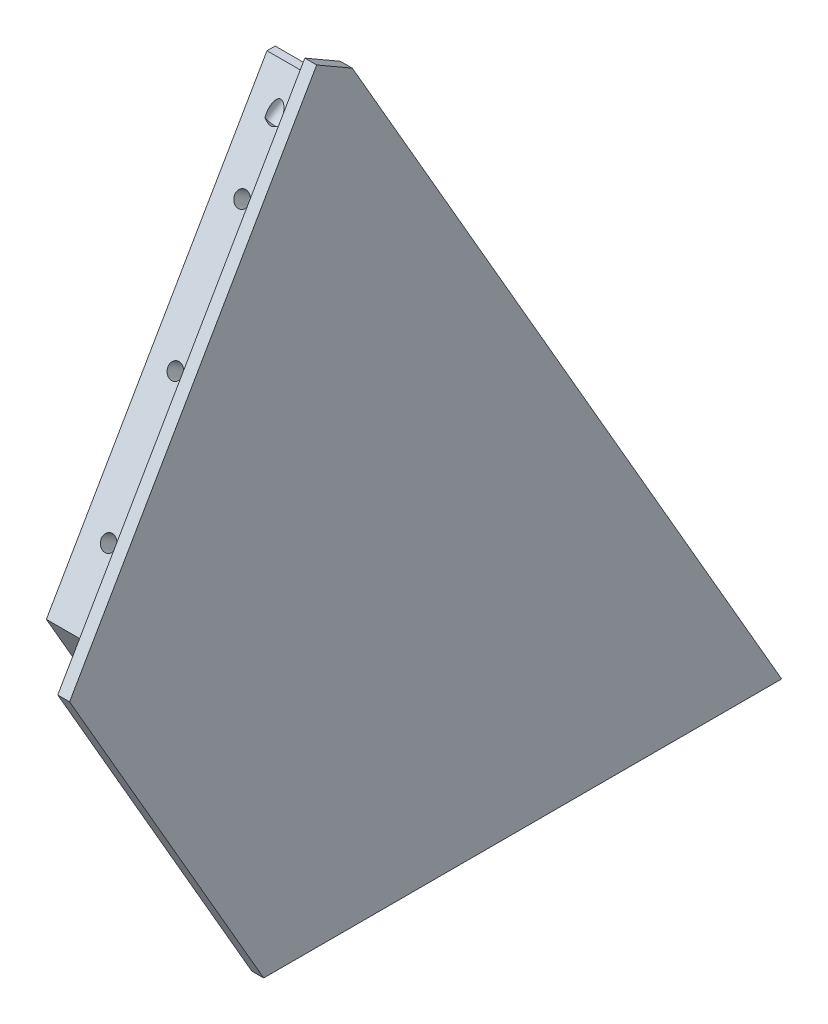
from build123d import *

# Parameters (mm, degrees)
BOSS_EXTRUDE1_DEPTH            = 12
CUT_EXTRUDE1_DEPTH             = 150.122275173
CUT_EXTRUDE2_DEPTH             = 10
CUT_EXTRUDE4_DEPTH             = 10
SKETCH7_W                      = 76
SKETCH7_H                      = 8
CUT_EXTRUDE6_DEPTH             = 10
CUT_EXTRUDE8_DEPTH             = 9
CUT_EXTRUDE9_DEPTH             = 6
CUT_EXTRUDE12_DEPTH            = 10
CUT_EXTRUDE13_DEPTH            = 10
FILLET1_R                      = 5
FILLET2_R                      = 7.5
M3X0_5_TAPPED_HOLE2_D          = 2.5
M3X0_5_TAPPED_HOLE2_DEPTH      = 8.5
M3X0_5_TAPPED_HOLE2_TIP        = 0.751075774
F_3_1_3_1_DIAMETER_HOLE2_D     = 3.1
F_3_1_3_1_DIAMETER_HOLE2_DEPTH = 5
M3X0_5_TAPPED_HOLE4_D          = 2.5
M3X0_5_TAPPED_HOLE4_DEPTH      = 5
M3X0_5_TAPPED_HOLE5_D          = 2.5
M3X0_5_TAPPED_HOLE5_DEPTH      = 8.5
M3X0_5_TAPPED_HOLE5_TIP        = 0.751075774
M3X0_5_TAPPED_HOLE7_D          = 2.5
M3X0_5_TAPPED_HOLE7_DEPTH      = 7.5
M3X0_5_TAPPED_HOLE7_TIP        = 0.751075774
M3X0_5_TAPPED_HOLE9_D          = 2.5
M3X0_5_TAPPED_HOLE9_DEPTH      = 4.69


with BuildPart() as part:
    # Sketch1 → Boss-Extrude1 (new body)
    with BuildSketch(Plane(origin=(0, 0, 0), x_dir=(0, 0, -1), z_dir=(1, 0, 0))):
        Polygon((-41.569219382, 102), (-67.729473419, 56.689110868), (-35, 0), (0, 0), (52.320508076, 0), (-24.069219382, 132.310889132), align=None)
    extrude(amount=BOSS_EXTRUDE1_DEPTH)

    # Sketch2 → Cut-Extrude1 (cut, through all)
    with BuildSketch(Plane(origin=(12, 0, 0), x_dir=(0, 0, -1), z_dir=(1, 0, 0))):
        Polygon((-26.069219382, 128.846787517), (-20.069219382, 125.382685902), (-24.069219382, 132.310889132), align=None)
    extrude(amount=-CUT_EXTRUDE1_DEPTH, mode=Mode.SUBTRACT)

    # Sketch3 → Cut-Extrude2 (cut)
    with BuildSketch(Plane.ZY):
        Polygon((26.069219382, 128.846787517), (27.069219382, 127.11473671), (21.533320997, 123.918584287), (-45, 8.679491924), (-45, 0), (-52.320508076, 0), (20.069219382, 125.382685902), align=None)
    extrude(amount=-CUT_EXTRUDE2_DEPTH, mode=Mode.SUBTRACT)

    # Sketch5 → Cut-Extrude4 (cut)
    with BuildSketch(Plane.ZY):
        Polygon((27.069219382, 127.11473671), (21.873066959, 124.11473671), (59.646569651, 58.689110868), (25.762395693, 0), (35, 0), (67.729473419, 56.689110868), align=None)
    extrude(amount=-CUT_EXTRUDE4_DEPTH, mode=Mode.SUBTRACT)

    # Sketch7 → Cut-Extrude6 (cut)
    with BuildSketch(Plane.ZY):
        with Locations((-7, 4)):
            Rectangle(SKETCH7_W, SKETCH7_H)
    extrude(amount=-CUT_EXTRUDE6_DEPTH, mode=Mode.SUBTRACT)

    # Sketch11 → Cut-Extrude8 (cut)
    with BuildSketch(Plane.ZY):
        Polygon((26.378620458, 106.310889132), (53.873066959, 58.689110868), (27.494446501, 13), (-27.494446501, 13), align=None)
    extrude(amount=-CUT_EXTRUDE8_DEPTH, mode=Mode.SUBTRACT)

    # Sketch13 → Cut-Extrude9 (cut)
    with BuildSketch(Plane.ZY):
        Polygon((16.771647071, 119.671123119), (25.700368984, 114.516123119), (-21.799631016, 32.243709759), (-30.728352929, 37.398709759), align=None)
    extrude(amount=-CUT_EXTRUDE9_DEPTH, mode=Mode.SUBTRACT)

    # Sketch16 → Cut-Extrude12 (cut)
    with BuildSketch(Plane.ZY):
        Polygon((-45, 8), (-44, 8), (-44, 10.411542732), (-45, 8.679491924), align=None)
    extrude(amount=-CUT_EXTRUDE12_DEPTH, mode=Mode.SUBTRACT)

    # Sketch17 → Cut-Extrude13 (cut)
    with BuildSketch(Plane.ZY):
        Polygon((22.450417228, 123.11473671), (21.069219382, 123.11473671), (21.533320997, 123.918584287), (21.873066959, 124.11473671), align=None)
    extrude(amount=-CUT_EXTRUDE13_DEPTH, mode=Mode.SUBTRACT)

    # Fillet1
    fillet1_edges = [part.edges().sort_by_distance(p)[0] for p in [
        (3, 32.243709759, -21.799631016),
        (3, 114.516123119, 25.700368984),
    ]]
    fillet(fillet1_edges, radius=FILLET1_R)

    # Fillet2
    fillet2_edges = [part.edges().sort_by_distance(p)[0] for p in [
        (4.5, 13, -27.494446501),
        (4.5, 106.310889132, 26.378620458),
        (4.5, 58.689110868, 53.873066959),
        (4.5, 13, 27.494446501),
    ]]
    fillet(fillet2_edges, radius=FILLET2_R)

    # M3x0.5 Tapped Hole2
    with Locations(Plane(origin=(0, 8, 0), x_dir=(-1, 0, 0), z_dir=(0, -1, 0))):
        with Locations((-4.5, -20), (-4.5, 5), (-4.5, 35)):
            Hole(M3X0_5_TAPPED_HOLE2_D / 2, depth=M3X0_5_TAPPED_HOLE2_DEPTH)
            with Locations((0, 0, -(M3X0_5_TAPPED_HOLE2_DEPTH + M3X0_5_TAPPED_HOLE2_TIP / 2))):  # 118° drill point
                Cone(0, M3X0_5_TAPPED_HOLE2_D / 2, M3X0_5_TAPPED_HOLE2_TIP, mode=Mode.SUBTRACT)

    # 3.1 _3.1_ Diameter Hole2
    with Locations(Plane(origin=(0, -11.155444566, 19.32179677), x_dir=(1, 0, 0), z_dir=(0, -0.5000000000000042, 0.8660254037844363))):
        with Locations((4.5, 34.118802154), (4.5, 69.118802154)):
            Hole(F_3_1_3_1_DIAMETER_HOLE2_D / 2, depth=F_3_1_3_1_DIAMETER_HOLE2_DEPTH)

    # M3x0.5 Tapped Hole4
    with Locations(Plane(origin=(0, 40.5, 70.148057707), x_dir=(1, 0, 0), z_dir=(0, 0.5000000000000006, 0.8660254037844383))):
        with Locations((4.5, 33.002976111), (4.5, 55.502976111)):
            Hole(M3X0_5_TAPPED_HOLE4_D / 2, depth=M3X0_5_TAPPED_HOLE4_DEPTH)

    # M3x0.5 Tapped Hole5
    with Locations(Plane(origin=(0, 40.5, 70.148057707), x_dir=(1, 0, 0), z_dir=(0, 0.5000000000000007, 0.8660254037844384))):
        with Locations((4.5, 78.002976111)):
            Hole(M3X0_5_TAPPED_HOLE5_D / 2, depth=M3X0_5_TAPPED_HOLE5_DEPTH)
            with Locations((0, 0, -(M3X0_5_TAPPED_HOLE5_DEPTH + M3X0_5_TAPPED_HOLE5_TIP / 2))):  # 118° drill point
                Cone(0, M3X0_5_TAPPED_HOLE5_D / 2, M3X0_5_TAPPED_HOLE5_TIP, mode=Mode.SUBTRACT)

    # M3x0.5 Tapped Hole7
    with Locations(Plane(origin=(0, 21.655444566, -37.508330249), x_dir=(-1, 0, 0), z_dir=(0, 0.499999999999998, -0.8660254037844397))):
        with Locations((-4.5, 114.438220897), (-4.5, 0.438220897)):
            Hole(M3X0_5_TAPPED_HOLE7_D / 2, depth=M3X0_5_TAPPED_HOLE7_DEPTH)
            with Locations((0, 0, -(M3X0_5_TAPPED_HOLE7_DEPTH + M3X0_5_TAPPED_HOLE7_TIP / 2))):  # 118° drill point
                Cone(0, M3X0_5_TAPPED_HOLE7_D / 2, M3X0_5_TAPPED_HOLE7_TIP, mode=Mode.SUBTRACT)

    # M3x0.5 Tapped Hole9
    with Locations(Plane(origin=(0, 17.500444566, -30.311659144), x_dir=(-1, 0, 0), z_dir=(0, 0.49999999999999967, -0.8660254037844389))):
        with Locations((-2.25, 88.019831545), (-2.25, 38.019831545)):
            Hole(M3X0_5_TAPPED_HOLE9_D / 2, depth=M3X0_5_TAPPED_HOLE9_DEPTH)


solid = part.part
